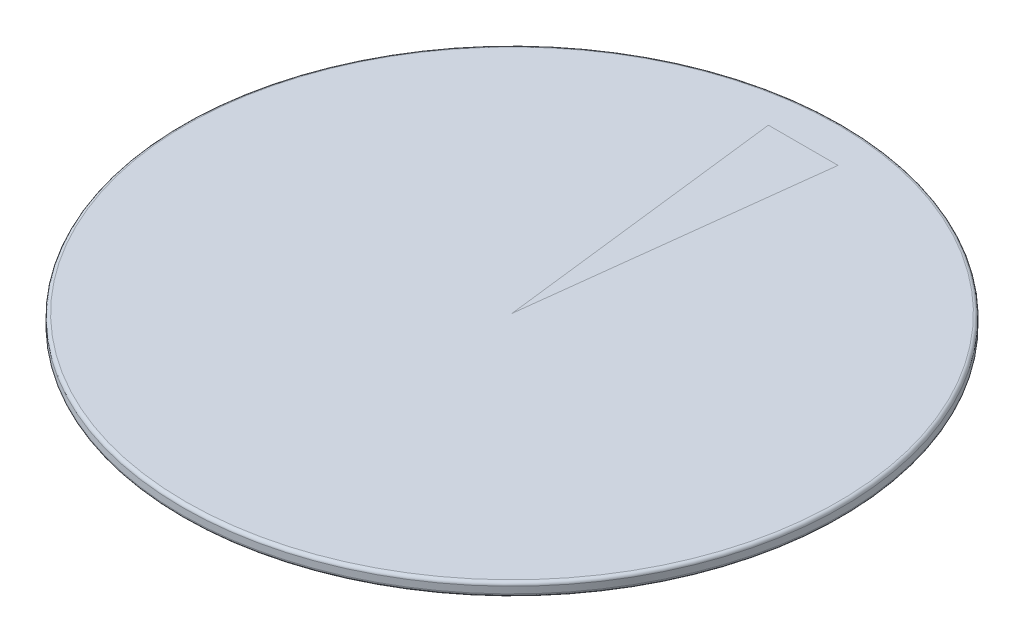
ISO-10303-21;
HEADER;
FILE_DESCRIPTION(('STEP AP214'),'2;1');
FILE_NAME('part.step','',(''),(''),'','','');
FILE_SCHEMA(('AUTOMOTIVE_DESIGN { 1 0 10303 214 1 1 1 1 }'));
ENDSEC;
DATA;
#1=APPLICATION_CONTEXT('core data for automotive mechanical design processes');
#2=APPLICATION_PROTOCOL_DEFINITION('international standard','automotive_design',2000,#1);
#3=PRODUCT_CONTEXT('',#1,'mechanical');
#4=PRODUCT('Part','Part','',(#3));
#5=PRODUCT_RELATED_PRODUCT_CATEGORY('part','',(#4));
#6=PRODUCT_DEFINITION_FORMATION('','',#4);
#7=PRODUCT_DEFINITION_CONTEXT('part definition',#1,'design');
#8=PRODUCT_DEFINITION('design','',#6,#7);
#9=PRODUCT_DEFINITION_SHAPE('','',#8);
#10=(LENGTH_UNIT() NAMED_UNIT(*) SI_UNIT(.MILLI.,.METRE.));
#11=(NAMED_UNIT(*) PLANE_ANGLE_UNIT() SI_UNIT($,.RADIAN.));
#12=(NAMED_UNIT(*) SI_UNIT($,.STERADIAN.) SOLID_ANGLE_UNIT());
#13=UNCERTAINTY_MEASURE_WITH_UNIT(LENGTH_MEASURE(1.E-05),#10,'distance_accuracy_value','');
#14=(GEOMETRIC_REPRESENTATION_CONTEXT(3) GLOBAL_UNCERTAINTY_ASSIGNED_CONTEXT((#13)) GLOBAL_UNIT_ASSIGNED_CONTEXT((#10,
#11,#12)) REPRESENTATION_CONTEXT('',''));
#15=CARTESIAN_POINT('',(0.,0.,0.));
#16=DIRECTION('',(0.,0.,1.));
#17=DIRECTION('',(1.,0.,0.));
#18=AXIS2_PLACEMENT_3D('',#15,#16,#17);
#19=CARTESIAN_POINT('',(0.,0.,0.));
#20=DIRECTION('',(0.,1.,0.));
#21=DIRECTION('',(0.,0.,1.));
#22=AXIS2_PLACEMENT_3D('',#19,#20,#21);
#23=PLANE('',#22);
#24=CARTESIAN_POINT('',(0.,0.,0.));
#25=DIRECTION('',(0.,1.,0.));
#26=DIRECTION('',(0.,0.,1.));
#27=AXIS2_PLACEMENT_3D('',#24,#25,#26);
#28=CIRCLE('',#27,24.75);
#29=CARTESIAN_POINT('',(0.,0.,24.75));
#30=VERTEX_POINT('',#29);
#31=EDGE_CURVE('E52',#30,#30,#28,.F.);
#32=ORIENTED_EDGE('',*,*,#31,.T.);
#33=EDGE_LOOP('',(#32));
#34=FACE_BOUND('',#33,.T.);
#35=DIRECTION('',(-0.118724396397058,0.,0.992927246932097));
#36=VECTOR('',#35,1.);
#37=CARTESIAN_POINT('',(0.,0.,0.));
#38=LINE('',#37,#36);
#39=CARTESIAN_POINT('',(2.64130636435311,0.,-22.0900264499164));
#40=VERTEX_POINT('',#39);
#41=CARTESIAN_POINT('',(0.,0.,0.));
#42=VERTEX_POINT('',#41);
#43=EDGE_CURVE('E59',#40,#42,#38,.T.);
#44=ORIENTED_EDGE('',*,*,#43,.F.);
#45=DIRECTION('',(1.,0.,0.));
#46=VECTOR('',#45,1.);
#47=CARTESIAN_POINT('',(0.,0.,-22.0900264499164));
#48=LINE('',#47,#46);
#49=CARTESIAN_POINT('',(-2.6413063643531,0.,-22.0900264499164));
#50=VERTEX_POINT('',#49);
#51=EDGE_CURVE('E62',#50,#40,#48,.T.);
#52=ORIENTED_EDGE('',*,*,#51,.F.);
#53=DIRECTION('',(-0.118724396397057,0.,-0.992927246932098));
#54=VECTOR('',#53,1.);
#55=CARTESIAN_POINT('',(0.,0.,0.));
#56=LINE('',#55,#54);
#57=EDGE_CURVE('E84',#42,#50,#56,.T.);
#58=ORIENTED_EDGE('',*,*,#57,.F.);
#59=EDGE_LOOP('',(#44,#52,#58));
#60=FACE_BOUND('',#59,.T.);
#61=ADVANCED_FACE('F43',(#34,#60),#23,.F.);
#62=CARTESIAN_POINT('',(0.,1.,0.));
#63=DIRECTION('',(0.,1.,0.));
#64=DIRECTION('',(0.,0.,1.));
#65=AXIS2_PLACEMENT_3D('',#62,#63,#64);
#66=PLANE('',#65);
#67=CARTESIAN_POINT('',(0.,1.,0.));
#68=DIRECTION('',(0.,1.,0.));
#69=DIRECTION('',(0.,0.,1.));
#70=AXIS2_PLACEMENT_3D('',#67,#68,#69);
#71=CIRCLE('',#70,24.75);
#72=CARTESIAN_POINT('',(0.,1.,24.75));
#73=VERTEX_POINT('',#72);
#74=EDGE_CURVE('E11',#73,#73,#71,.T.);
#75=ORIENTED_EDGE('',*,*,#74,.T.);
#76=EDGE_LOOP('',(#75));
#77=FACE_BOUND('',#76,.T.);
#78=DIRECTION('',(1.,0.,0.));
#79=VECTOR('',#78,1.);
#80=CARTESIAN_POINT('',(0.,1.,-22.0900264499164));
#81=LINE('',#80,#79);
#82=CARTESIAN_POINT('',(-2.6413063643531,1.,-22.0900264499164));
#83=VERTEX_POINT('',#82);
#84=CARTESIAN_POINT('',(2.64130636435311,1.,-22.0900264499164));
#85=VERTEX_POINT('',#84);
#86=EDGE_CURVE('E81',#83,#85,#81,.T.);
#87=ORIENTED_EDGE('',*,*,#86,.T.);
#88=DIRECTION('',(-0.118724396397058,0.,0.992927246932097));
#89=VECTOR('',#88,1.);
#90=CARTESIAN_POINT('',(0.,1.,0.));
#91=LINE('',#90,#89);
#92=CARTESIAN_POINT('',(0.,1.,0.));
#93=VERTEX_POINT('',#92);
#94=EDGE_CURVE('E77',#85,#93,#91,.T.);
#95=ORIENTED_EDGE('',*,*,#94,.T.);
#96=DIRECTION('',(-0.118724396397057,0.,-0.992927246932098));
#97=VECTOR('',#96,1.);
#98=CARTESIAN_POINT('',(0.,1.,0.));
#99=LINE('',#98,#97);
#100=EDGE_CURVE('E80',#93,#83,#99,.T.);
#101=ORIENTED_EDGE('',*,*,#100,.T.);
#102=EDGE_LOOP('',(#87,#95,#101));
#103=FACE_BOUND('',#102,.T.);
#104=ADVANCED_FACE('F79',(#77,#103),#66,.T.);
#105=CARTESIAN_POINT('',(0.,1.,0.));
#106=DIRECTION('',(0.,-1.,0.));
#107=DIRECTION('',(0.,0.,-1.));
#108=AXIS2_PLACEMENT_3D('',#105,#106,#107);
#109=CYLINDRICAL_SURFACE('',#108,25.);
#110=CARTESIAN_POINT('',(0.,0.25,0.));
#111=DIRECTION('',(0.,1.,0.));
#112=DIRECTION('',(0.,0.,1.));
#113=AXIS2_PLACEMENT_3D('',#110,#111,#112);
#114=CIRCLE('',#113,25.);
#115=CARTESIAN_POINT('',(0.,0.25,25.));
#116=VERTEX_POINT('',#115);
#117=EDGE_CURVE('E103',#116,#116,#114,.T.);
#118=ORIENTED_EDGE('',*,*,#117,.T.);
#119=EDGE_LOOP('',(#118));
#120=FACE_BOUND('',#119,.T.);
#121=CARTESIAN_POINT('',(0.,0.75,0.));
#122=DIRECTION('',(0.,1.,0.));
#123=DIRECTION('',(0.,0.,1.));
#124=AXIS2_PLACEMENT_3D('',#121,#122,#123);
#125=CIRCLE('',#124,25.);
#126=CARTESIAN_POINT('',(0.,0.75,25.));
#127=VERTEX_POINT('',#126);
#128=EDGE_CURVE('E95',#127,#127,#125,.F.);
#129=ORIENTED_EDGE('',*,*,#128,.T.);
#130=EDGE_LOOP('',(#129));
#131=FACE_BOUND('',#130,.T.);
#132=ADVANCED_FACE('F117',(#120,#131),#109,.T.);
#133=ORIENTED_EDGE('',*,*,#94,.F.);
#134=ORIENTED_EDGE('',*,*,#86,.F.);
#135=ORIENTED_EDGE('',*,*,#100,.F.);
#136=EDGE_LOOP('',(#133,#134,#135));
#137=FACE_BOUND('',#136,.T.);
#138=ADVANCED_FACE('F86',(#137),#66,.T.);
#139=ORIENTED_EDGE('',*,*,#51,.T.);
#140=ORIENTED_EDGE('',*,*,#43,.T.);
#141=ORIENTED_EDGE('',*,*,#57,.T.);
#142=EDGE_LOOP('',(#139,#140,#141));
#143=FACE_BOUND('',#142,.T.);
#144=ADVANCED_FACE('F114',(#143),#23,.F.);
#145=CARTESIAN_POINT('',(0.,0.25,0.));
#146=DIRECTION('',(0.,1.,0.));
#147=DIRECTION('',(0.,0.,1.));
#148=AXIS2_PLACEMENT_3D('',#145,#146,#147);
#149=TOROIDAL_SURFACE('',#148,24.75,0.25);
#150=ORIENTED_EDGE('',*,*,#31,.F.);
#151=EDGE_LOOP('',(#150));
#152=FACE_BOUND('',#151,.T.);
#153=ORIENTED_EDGE('',*,*,#117,.F.);
#154=EDGE_LOOP('',(#153));
#155=FACE_BOUND('',#154,.T.);
#156=ADVANCED_FACE('F111',(#152,#155),#149,.T.);
#157=CARTESIAN_POINT('',(0.,0.75,0.));
#158=DIRECTION('',(0.,1.,0.));
#159=DIRECTION('',(0.,0.,1.));
#160=AXIS2_PLACEMENT_3D('',#157,#158,#159);
#161=TOROIDAL_SURFACE('',#160,24.75,0.25);
#162=ORIENTED_EDGE('',*,*,#128,.F.);
#163=EDGE_LOOP('',(#162));
#164=FACE_BOUND('',#163,.T.);
#165=ORIENTED_EDGE('',*,*,#74,.F.);
#166=EDGE_LOOP('',(#165));
#167=FACE_BOUND('',#166,.T.);
#168=ADVANCED_FACE('F45',(#164,#167),#161,.T.);
#169=CLOSED_SHELL('',(#61,#104,#132,#138,#144,#156,#168));
#170=MANIFOLD_SOLID_BREP('B2',#169);
#171=ADVANCED_BREP_SHAPE_REPRESENTATION('',(#18,#170),#14);
#172=SHAPE_DEFINITION_REPRESENTATION(#9,#171);
ENDSEC;
END-ISO-10303-21;
